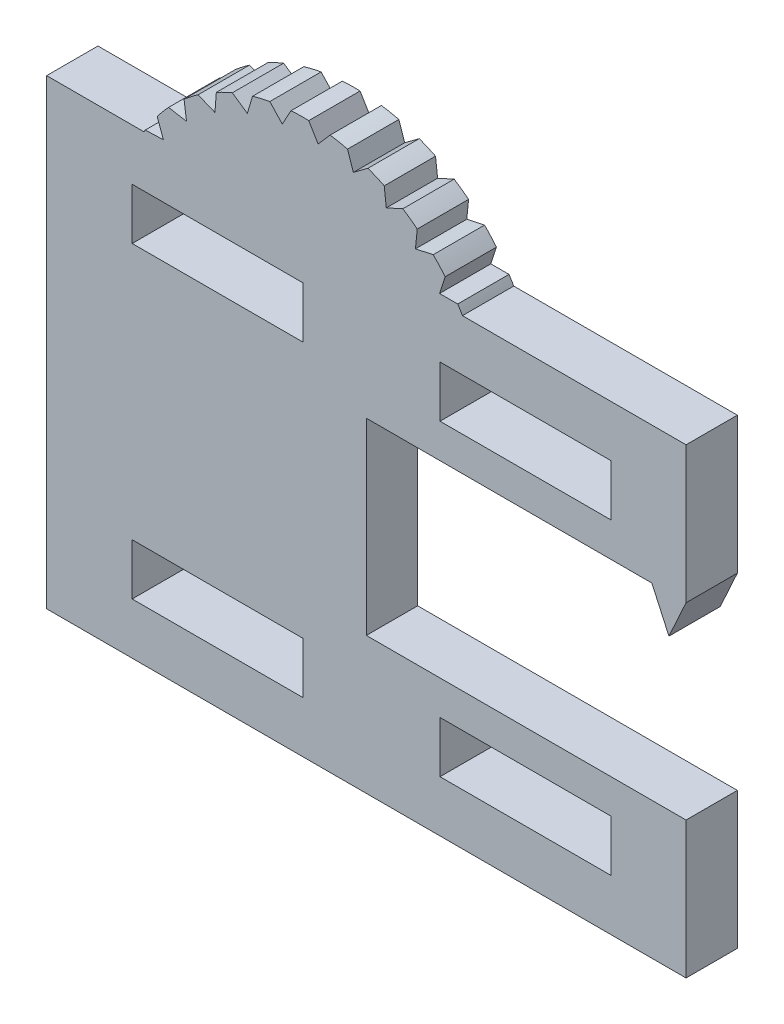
from build123d import *

# Parameters (mm, degrees)
ESQUISSE1_W             = 37.384651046
ESQUISSE1_H             = 27
ESQUISSE1_W_2           = 30
ESQUISSE1_H_2           = 11
ESQUISSE1_W_3           = 10
ESQUISSE1_H_3           = 3
BOSS_EXTRU_1_DEPTH      = 3
ESQUISSE2_W             = 15
ESQUISSE2_H             = 11
BOSS_EXTRU_2_DEPTH      = 3
ESQUISSE3_W             = 3.692325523
ESQUISSE3_H             = 11
ENL_V_MAT_EXTRU_1_DEPTH = 3
BOSS_EXTRU_3_DEPTH      = 3
BOSS_EXTRU_4_DEPTH      = 3


with BuildPart() as part:
    # Esquisse1 → Boss.-Extru.1 (new body)
    with BuildSketch(Plane.XY):
        with Locations((-26.692325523, 7.5)):
            Rectangle(ESQUISSE1_W, ESQUISSE1_H)
        with Locations((-26.692325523, 7.5)):
            Rectangle(ESQUISSE1_W_2, ESQUISSE1_H_2, mode=Mode.SUBTRACT)
        with Locations((-17.384651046, -1.5)):
            Rectangle(ESQUISSE1_W_3, ESQUISSE1_H_3, mode=Mode.SUBTRACT)
        with Locations((-35.384651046, -1.5)):
            Rectangle(ESQUISSE1_W_3, ESQUISSE1_H_3, mode=Mode.SUBTRACT)
        with Locations((-17.384651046, 16.5)):
            Rectangle(ESQUISSE1_W_3, ESQUISSE1_H_3, mode=Mode.SUBTRACT)
        with Locations((-35.384651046, 16.5)):
            Rectangle(ESQUISSE1_W_3, ESQUISSE1_H_3, mode=Mode.SUBTRACT)
    extrude(amount=BOSS_EXTRU_1_DEPTH)

    # Esquisse2 → Boss.-Extru.2 (add)
    with BuildSketch(Plane.XY.offset(3)):
        with Locations((-34.192325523, 7.5)):
            Rectangle(ESQUISSE2_W, ESQUISSE2_H)
    extrude(amount=-BOSS_EXTRU_2_DEPTH)

    # Esquisse3 → Enl_v. mat.-Extru.1 (cut)
    with BuildSketch(Plane.XY.offset(3)):
        with Locations((-9.846162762, 7.5)):
            Rectangle(ESQUISSE3_W, ESQUISSE3_H)
    extrude(amount=-ENL_V_MAT_EXTRU_1_DEPTH, mode=Mode.SUBTRACT)

    # Esquisse4 → Boss.-Extru.3 (add)
    with BuildSketch(Plane.XY.offset(3)):
        Polygon((-8, 13), (-9, 10.809144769), (-10, 13), align=None)
    extrude(amount=-BOSS_EXTRU_3_DEPTH)

    # Esquisse5 → Boss.-Extru.4 (add)
    with BuildSketch(Plane.XY.offset(3)):
        with BuildLine():
            Line((-27.452276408, 25.066477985), (-27.79367863, 26.07423461))
            ThreePointArc((-27.79367863, 26.07423461), (-28.299982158, 26.187245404), (-28.81115425, 26.275663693))
            Line((-28.81115425, 26.275663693), (-29.510767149, 25.473996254))
            Line((-29.510767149, 25.473996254), (-30.057777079, 26.386634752))
            ThreePointArc((-30.057777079, 26.386634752), (-30.576529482, 26.389897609), (-31.094833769, 26.368094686))
            Line((-31.094833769, 26.368094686), (-31.608873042, 25.436487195))
            Line((-31.608873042, 25.436487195), (-32.336693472, 26.212635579))
            ThreePointArc((-32.336693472, 26.212635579), (-32.844378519, 26.106002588), (-33.346319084, 25.974966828))
            Line((-33.346319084, 25.974966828), (-33.651482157, 24.95565118))
            Line((-33.651482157, 24.95565118), (-34.527119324, 25.560124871))
            ThreePointArc((-34.527119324, 25.560124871), (-35.000722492, 25.348429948), (-35.463545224, 25.114101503))
            Line((-35.463545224, 25.114101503), (-35.545998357, 24.053285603))
            Line((-35.545998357, 24.053285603), (-36.529757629, 24.458682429))
            ThreePointArc((-36.529757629, 24.458682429), (-36.947809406, 24.151522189), (-37.350533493, 23.8245237))
            Line((-37.350533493, 23.8245237), (-37.206538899, 22.770296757))
            Line((-37.206538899, 22.770296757), (-38.253824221, 22.958239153))
            ThreePointArc((-38.253824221, 22.958239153), (-38.597373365, 22.56953787), (-38.921742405, 22.164692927))
            Line((-38.921742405, 22.164692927), (-38.557827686, 21.164845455))
            Line((-38.557827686, 21.164845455), (-39.621163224, 21.126813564))
            ThreePointArc((-39.621163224, 21.126813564), (-39.658346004, 21.063533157), (-39.69509525, 21))
            Line((-39.69509525, 21), (-21.074206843, 21))
            ThreePointArc((-21.074206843, 21), (-21.209078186, 21.228434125), (-21.349553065, 21.453465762))
            Line((-21.349553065, 21.453465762), (-22.413568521, 21.453465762))
            Line((-22.413568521, 21.453465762), (-22.085624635, 22.465681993))
            ThreePointArc((-22.085624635, 22.465681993), (-22.424257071, 22.858674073), (-22.78148032, 23.23484724))
            Line((-22.78148032, 23.23484724), (-23.821378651, 23.009591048))
            Line((-23.821378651, 23.009591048), (-23.715158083, 24.068291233))
            ThreePointArc((-23.715158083, 24.068291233), (-24.129312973, 24.380685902), (-24.558076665, 24.67270713))
            Line((-24.558076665, 24.67270713), (-25.526716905, 24.232406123))
            Line((-25.526716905, 24.232406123), (-25.647034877, 25.289596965))
            ThreePointArc((-25.647034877, 25.289596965), (-26.117937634, 25.507232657), (-26.598804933, 25.701863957))
            Line((-26.598804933, 25.701863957), (-27.452276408, 25.066477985))
        make_face()
    extrude(amount=-BOSS_EXTRU_4_DEPTH)


solid = part.part
